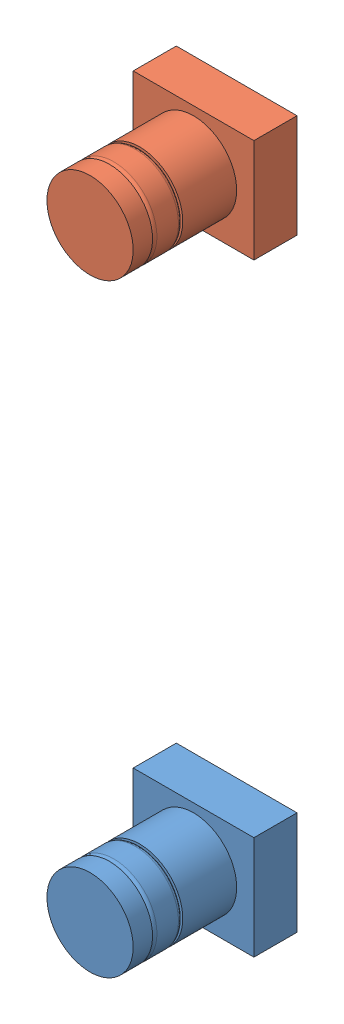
SolidWorks assembly img88-1214k.SLDASM, configuration Default (file format 16000). Lengths in mm.
Overall size (14 82 17).
2 component instances, 2 part files, 0 mates.
Components (placement in the parent):
- img88-1214k_01-1: img88-1214k_01.SLDPRT [ﾃﾞﾌｫﾙﾄ] at origin size (14 12 17)
- img88-1214k_02-1: img88-1214k_02.SLDPRT [ﾃﾞﾌｫﾙﾄ] at (0 70 0) size (14 12 17)
